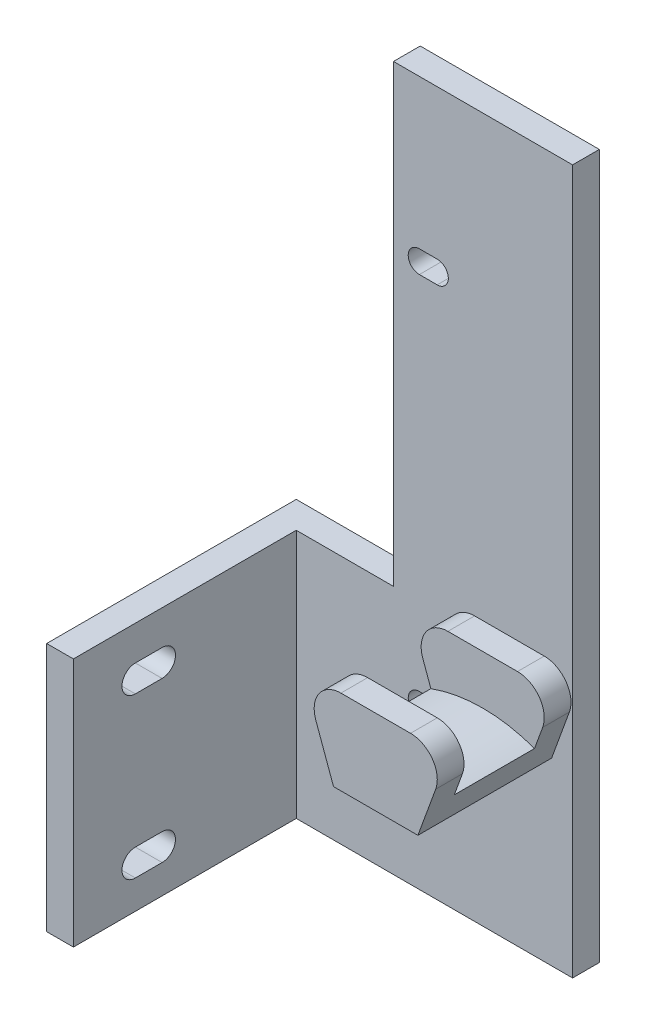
from build123d import *

# Parameters (mm, degrees)
SKETCH1_W           = 34
SKETCH1_H           = 79
BOSS_EXTRUDE1_DEPTH = 3
BOSS_EXTRUDE2_DEPTH = 12
SKETCH4_W           = 3
SKETCH4_H           = 28
BOSS_EXTRUDE3_DEPTH = 25
BOSS_EXTRUDE4_DEPTH = 3
BOSS_EXTRUDE5_START = -12
BOSS_EXTRUDE5_DEPTH = 3
SKETCH6_W           = 13.907172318
SKETCH6_H           = 51
CUT_EXTRUDE1_DEPTH  = 10
CUT_EXTRUDE2_DEPTH  = 10
CUT_EXTRUDE3_DEPTH  = 10


with BuildPart() as part:
    # Sketch1 → Boss-Extrude1 (new body)
    with BuildSketch(Plane.XY):
        with Locations((-17, -39.5)):
            Rectangle(SKETCH1_W, SKETCH1_H)
    extrude(amount=BOSS_EXTRUDE1_DEPTH)

    # Sketch2 → Boss-Extrude2 (add)
    with BuildSketch(Plane.XY.offset(3)):
        with BuildLine():
            Line((-12.89981684, -55.840343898), (-11.817087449, -58.815118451))
            Line((-11.817087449, -58.815118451), (-2.353861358, -58.815118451))
            Line((-2.353861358, -58.815118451), (-1.271131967, -55.840343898))
            ThreePointArc((-1.271131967, -55.840343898), (-7.085474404, -54.815118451), (-12.89981684, -55.840343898))
        make_face()
    extrude(amount=BOSS_EXTRUDE2_DEPTH)

    # Sketch4 → Boss-Extrude3 (add)
    with BuildSketch(Plane.XY.offset(3)):
        with Locations((-32.5, -65)):
            Rectangle(SKETCH4_W, SKETCH4_H)
    extrude(amount=BOSS_EXTRUDE3_DEPTH)

    # Sketch5 → Boss-Extrude4 (add)
    with BuildSketch(Plane.XY.offset(15)):
        with BuildLine():
            Line((-11.817087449, -58.815118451), (-2.353861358, -58.815118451))
            Line((-2.353861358, -58.815118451), (-0.361510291, -53.341178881))
            ThreePointArc((-0.361510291, -53.341178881), (-0.72313202, -50.594389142), (-3.180588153, -49.315118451))
            Line((-3.180588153, -49.315118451), (-10.990360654, -49.315118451))
            ThreePointArc((-10.990360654, -49.315118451), (-13.447816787, -50.594389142), (-13.809438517, -53.341178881))
            Line((-13.809438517, -53.341178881), (-11.817087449, -58.815118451))
        make_face()
    extrude(amount=BOSS_EXTRUDE4_DEPTH)

    # Sketch5_2 → Boss-Extrude5 (add)
    with BuildSketch(Plane.XY.offset(15).offset(BOSS_EXTRUDE5_START)):
        with BuildLine():
            Line((-11.817087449, -58.815118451), (-2.353861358, -58.815118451))
            Line((-2.353861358, -58.815118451), (-0.361510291, -53.341178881))
            ThreePointArc((-0.361510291, -53.341178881), (-0.72313202, -50.594389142), (-3.180588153, -49.315118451))
            Line((-3.180588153, -49.315118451), (-10.990360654, -49.315118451))
            ThreePointArc((-10.990360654, -49.315118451), (-13.447816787, -50.594389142), (-13.809438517, -53.341178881))
            Line((-13.809438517, -53.341178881), (-11.817087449, -58.815118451))
        make_face()
    extrude(amount=BOSS_EXTRUDE5_DEPTH)

    # Sketch6 → Cut-Extrude1 (cut)
    with BuildSketch(Plane.XY.offset(3)):
        with Locations((-27.046413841, -25.5)):
            Rectangle(SKETCH6_W, SKETCH6_H)
    extrude(amount=-CUT_EXTRUDE1_DEPTH, mode=Mode.SUBTRACT)

    # Sketch7 → Cut-Extrude2 (cut)
    with BuildSketch(Plane(origin=(-31, 0, 0), x_dir=(0, 0, -1), z_dir=(1, 0, 0))):
        with BuildLine():
            Line((-18.05, -75.75611961), (-21.05, -75.75611961))
            ThreePointArc((-21.05, -75.75611961), (-22.55, -74.25611961), (-21.05, -72.75611961))
            Line((-21.05, -72.75611961), (-18.05, -72.75611961))
            ThreePointArc((-18.05, -72.75611961), (-16.55, -74.25611961), (-18.05, -75.75611961))
        make_face()
        with BuildLine():
            Line((-18.05, -54.87026735), (-21.05, -54.87026735))
            ThreePointArc((-21.05, -54.87026735), (-22.55, -56.37026735), (-21.05, -57.87026735))
            Line((-21.05, -57.87026735), (-18.05, -57.87026735))
            ThreePointArc((-18.05, -57.87026735), (-16.55, -56.37026735), (-18.05, -54.87026735))
        make_face()
    extrude(amount=-CUT_EXTRUDE2_DEPTH, mode=Mode.SUBTRACT)

    # Sketch8 → Cut-Extrude3 (cut)
    with BuildSketch(Plane(origin=(0, 0, 0), x_dir=(-1, 0, 0), z_dir=(0, 0, -1))):
        with BuildLine():
            Line((17.189957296, -19.25), (15.189957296, -19.25))
            ThreePointArc((15.189957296, -19.25), (13.939957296, -18), (15.189957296, -16.75))
            Line((15.189957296, -16.75), (17.189957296, -16.75))
            ThreePointArc((17.189957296, -16.75), (18.439957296, -18), (17.189957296, -19.25))
        make_face()
        with BuildLine():
            Line((17.189957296, -59.760202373), (15.189957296, -59.760202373))
            ThreePointArc((15.189957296, -59.760202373), (13.939957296, -61.010202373), (15.189957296, -62.260202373))
            Line((15.189957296, -62.260202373), (17.189957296, -62.260202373))
            ThreePointArc((17.189957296, -62.260202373), (18.439957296, -61.010202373), (17.189957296, -59.760202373))
        make_face()
    extrude(amount=-CUT_EXTRUDE3_DEPTH, mode=Mode.SUBTRACT)


solid = part.part
